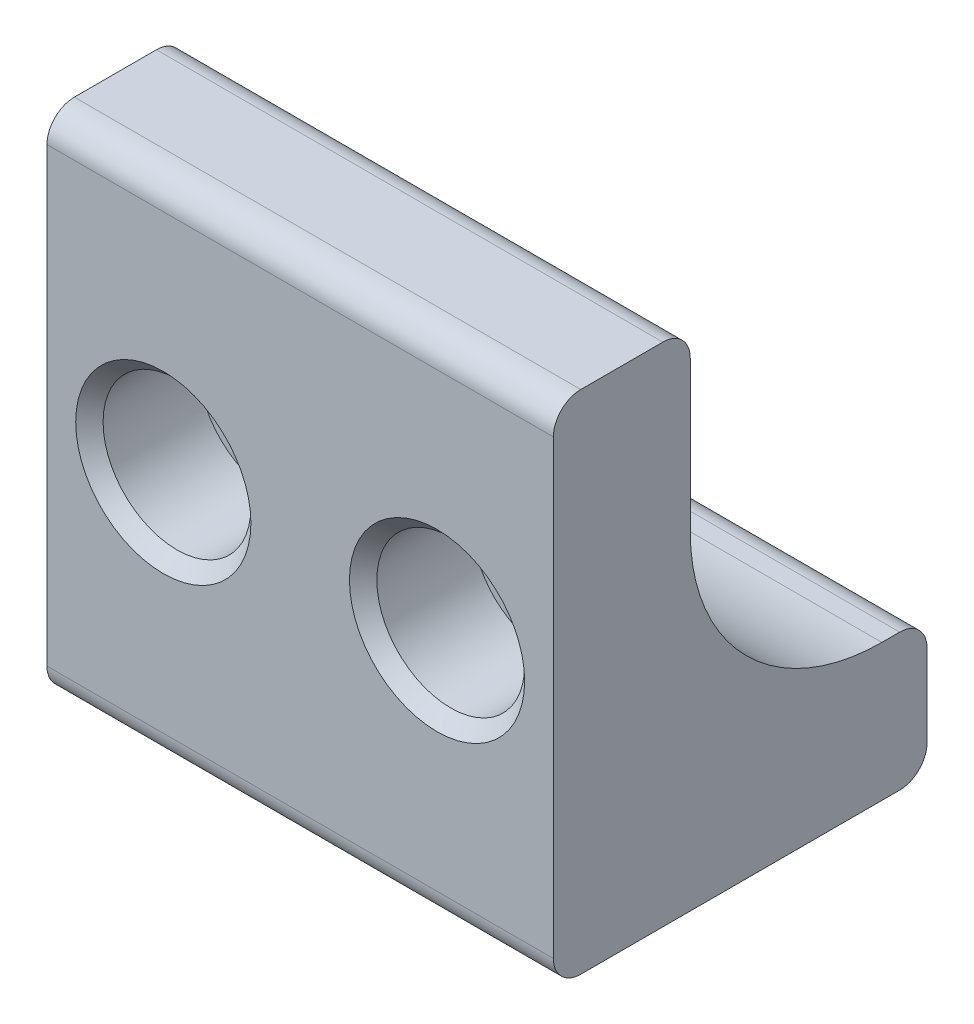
ISO-10303-21;
HEADER;
FILE_DESCRIPTION(('STEP AP214'),'2;1');
FILE_NAME('part.step','',(''),(''),'','','');
FILE_SCHEMA(('AUTOMOTIVE_DESIGN { 1 0 10303 214 1 1 1 1 }'));
ENDSEC;
DATA;
#1=APPLICATION_CONTEXT('core data for automotive mechanical design processes');
#2=APPLICATION_PROTOCOL_DEFINITION('international standard','automotive_design',2000,#1);
#3=PRODUCT_CONTEXT('',#1,'mechanical');
#4=PRODUCT('Part','Part','',(#3));
#5=PRODUCT_RELATED_PRODUCT_CATEGORY('part','',(#4));
#6=PRODUCT_DEFINITION_FORMATION('','',#4);
#7=PRODUCT_DEFINITION_CONTEXT('part definition',#1,'design');
#8=PRODUCT_DEFINITION('design','',#6,#7);
#9=PRODUCT_DEFINITION_SHAPE('','',#8);
#10=(LENGTH_UNIT() NAMED_UNIT(*) SI_UNIT(.MILLI.,.METRE.));
#11=(NAMED_UNIT(*) PLANE_ANGLE_UNIT() SI_UNIT($,.RADIAN.));
#12=(NAMED_UNIT(*) SI_UNIT($,.STERADIAN.) SOLID_ANGLE_UNIT());
#13=UNCERTAINTY_MEASURE_WITH_UNIT(LENGTH_MEASURE(1.E-05),#10,'distance_accuracy_value','');
#14=(GEOMETRIC_REPRESENTATION_CONTEXT(3) GLOBAL_UNCERTAINTY_ASSIGNED_CONTEXT((#13)) GLOBAL_UNIT_ASSIGNED_CONTEXT((#10,
#11,#12)) REPRESENTATION_CONTEXT('',''));
#15=CARTESIAN_POINT('',(0.,0.,0.));
#16=DIRECTION('',(0.,0.,1.));
#17=DIRECTION('',(1.,0.,0.));
#18=AXIS2_PLACEMENT_3D('',#15,#16,#17);
#19=CARTESIAN_POINT('',(41.,-25.49,129.225));
#20=DIRECTION('',(-1.,0.,0.));
#21=DIRECTION('',(0.,0.,1.));
#22=AXIS2_PLACEMENT_3D('',#19,#20,#21);
#23=PLANE('',#22);
#24=DIRECTION('',(0.,-1.,0.));
#25=VECTOR('',#24,1.);
#26=CARTESIAN_POINT('',(41.,-25.49,129.225));
#27=LINE('',#26,#25);
#28=CARTESIAN_POINT('',(41.,-39.99,129.225));
#29=VERTEX_POINT('',#28);
#30=CARTESIAN_POINT('',(41.,-42.99,129.225));
#31=VERTEX_POINT('',#30);
#32=EDGE_CURVE('E142',#29,#31,#27,.T.);
#33=ORIENTED_EDGE('',*,*,#32,.F.);
#34=CARTESIAN_POINT('',(41.,-39.99,130.225));
#35=DIRECTION('',(-1.,0.,0.));
#36=DIRECTION('',(0.,0.,1.));
#37=AXIS2_PLACEMENT_3D('',#34,#35,#36);
#38=CIRCLE('',#37,1.);
#39=CARTESIAN_POINT('',(41.,-38.99,130.225));
#40=VERTEX_POINT('',#39);
#41=EDGE_CURVE('E146',#29,#40,#38,.F.);
#42=ORIENTED_EDGE('',*,*,#41,.T.);
#43=DIRECTION('',(0.,0.,-1.));
#44=VECTOR('',#43,1.);
#45=CARTESIAN_POINT('',(41.,-38.99,129.225));
#46=LINE('',#45,#44);
#47=CARTESIAN_POINT('',(41.,-38.99,130.875));
#48=VERTEX_POINT('',#47);
#49=EDGE_CURVE('E137',#48,#40,#46,.T.);
#50=ORIENTED_EDGE('',*,*,#49,.F.);
#51=CARTESIAN_POINT('',(41.,-31.99,130.875));
#52=DIRECTION('',(-1.,0.,0.));
#53=DIRECTION('',(0.,0.,1.));
#54=AXIS2_PLACEMENT_3D('',#51,#52,#53);
#55=CIRCLE('',#54,7.);
#56=CARTESIAN_POINT('',(41.,-31.99,137.875));
#57=VERTEX_POINT('',#56);
#58=EDGE_CURVE('E122',#48,#57,#55,.T.);
#59=ORIENTED_EDGE('',*,*,#58,.T.);
#60=DIRECTION('',(0.,1.,0.));
#61=VECTOR('',#60,1.);
#62=CARTESIAN_POINT('',(41.,-64.4123529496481,137.875));
#63=LINE('',#62,#61);
#64=CARTESIAN_POINT('',(41.,-26.49,137.875));
#65=VERTEX_POINT('',#64);
#66=EDGE_CURVE('E148',#57,#65,#63,.T.);
#67=ORIENTED_EDGE('',*,*,#66,.T.);
#68=CARTESIAN_POINT('',(41.,-26.49,138.875));
#69=DIRECTION('',(-1.,0.,0.));
#70=DIRECTION('',(0.,0.,1.));
#71=AXIS2_PLACEMENT_3D('',#68,#69,#70);
#72=CIRCLE('',#71,1.);
#73=CARTESIAN_POINT('',(41.,-25.49,138.875));
#74=VERTEX_POINT('',#73);
#75=EDGE_CURVE('E199',#65,#74,#72,.F.);
#76=ORIENTED_EDGE('',*,*,#75,.T.);
#77=DIRECTION('',(0.,0.,-1.));
#78=VECTOR('',#77,1.);
#79=CARTESIAN_POINT('',(41.,-25.49,129.225));
#80=LINE('',#79,#78);
#81=CARTESIAN_POINT('',(41.,-25.49,141.875));
#82=VERTEX_POINT('',#81);
#83=EDGE_CURVE('E162',#82,#74,#80,.T.);
#84=ORIENTED_EDGE('',*,*,#83,.F.);
#85=CARTESIAN_POINT('',(41.,-26.49,141.875));
#86=DIRECTION('',(-1.,0.,0.));
#87=DIRECTION('',(0.,0.,1.));
#88=AXIS2_PLACEMENT_3D('',#85,#86,#87);
#89=CIRCLE('',#88,1.);
#90=CARTESIAN_POINT('',(41.,-26.49,142.875));
#91=VERTEX_POINT('',#90);
#92=EDGE_CURVE('E201',#82,#91,#89,.F.);
#93=ORIENTED_EDGE('',*,*,#92,.T.);
#94=DIRECTION('',(0.,-1.,0.));
#95=VECTOR('',#94,1.);
#96=CARTESIAN_POINT('',(41.,-25.49,142.875));
#97=LINE('',#96,#95);
#98=CARTESIAN_POINT('',(41.,-42.99,142.875));
#99=VERTEX_POINT('',#98);
#100=EDGE_CURVE('E167',#91,#99,#97,.T.);
#101=ORIENTED_EDGE('',*,*,#100,.T.);
#102=CARTESIAN_POINT('',(41.,-42.99,141.875));
#103=DIRECTION('',(-1.,0.,0.));
#104=DIRECTION('',(0.,0.,1.));
#105=AXIS2_PLACEMENT_3D('',#102,#103,#104);
#106=CIRCLE('',#105,1.);
#107=CARTESIAN_POINT('',(41.,-43.99,141.875));
#108=VERTEX_POINT('',#107);
#109=EDGE_CURVE('E54',#99,#108,#106,.F.);
#110=ORIENTED_EDGE('',*,*,#109,.T.);
#111=DIRECTION('',(0.,0.,-1.));
#112=VECTOR('',#111,1.);
#113=CARTESIAN_POINT('',(41.,-43.99,129.225));
#114=LINE('',#113,#112);
#115=CARTESIAN_POINT('',(41.,-43.99,130.225));
#116=VERTEX_POINT('',#115);
#117=EDGE_CURVE('E147',#108,#116,#114,.T.);
#118=ORIENTED_EDGE('',*,*,#117,.T.);
#119=CARTESIAN_POINT('',(41.,-42.99,130.225));
#120=DIRECTION('',(-1.,0.,0.));
#121=DIRECTION('',(0.,0.,1.));
#122=AXIS2_PLACEMENT_3D('',#119,#120,#121);
#123=CIRCLE('',#122,1.);
#124=EDGE_CURVE('E204',#116,#31,#123,.F.);
#125=ORIENTED_EDGE('',*,*,#124,.T.);
#126=EDGE_LOOP('',(#33,#42,#50,#59,#67,#76,#84,#93,#101,#110,#118,#125));
#127=FACE_BOUND('',#126,.T.);
#128=ADVANCED_FACE('F32',(#127),#23,.F.);
#129=CARTESIAN_POINT('',(22.5,-25.49,129.225));
#130=DIRECTION('',(0.,0.,1.));
#131=DIRECTION('',(1.,0.,0.));
#132=AXIS2_PLACEMENT_3D('',#129,#130,#131);
#133=PLANE('',#132);
#134=DIRECTION('',(0.,-1.,0.));
#135=VECTOR('',#134,1.);
#136=CARTESIAN_POINT('',(22.5,-25.49,129.225));
#137=LINE('',#136,#135);
#138=CARTESIAN_POINT('',(22.5,-39.99,129.225));
#139=VERTEX_POINT('',#138);
#140=CARTESIAN_POINT('',(22.5,-42.99,129.225));
#141=VERTEX_POINT('',#140);
#142=EDGE_CURVE('E175',#139,#141,#137,.T.);
#143=ORIENTED_EDGE('',*,*,#142,.F.);
#144=DIRECTION('',(-1.,0.,0.));
#145=VECTOR('',#144,1.);
#146=CARTESIAN_POINT('',(22.5,-39.99,129.225));
#147=LINE('',#146,#145);
#148=EDGE_CURVE('E197',#139,#29,#147,.F.);
#149=ORIENTED_EDGE('',*,*,#148,.T.);
#150=ORIENTED_EDGE('',*,*,#32,.T.);
#151=DIRECTION('',(-1.,0.,0.));
#152=VECTOR('',#151,1.);
#153=CARTESIAN_POINT('',(22.5,-42.99,129.225));
#154=LINE('',#153,#152);
#155=EDGE_CURVE('E194',#31,#141,#154,.T.);
#156=ORIENTED_EDGE('',*,*,#155,.T.);
#157=EDGE_LOOP('',(#143,#149,#150,#156));
#158=FACE_BOUND('',#157,.T.);
#159=ADVANCED_FACE('F260',(#158),#133,.F.);
#160=CARTESIAN_POINT('',(22.5,-25.49,129.225));
#161=DIRECTION('',(1.,0.,0.));
#162=DIRECTION('',(0.,0.,-1.));
#163=AXIS2_PLACEMENT_3D('',#160,#161,#162);
#164=PLANE('',#163);
#165=DIRECTION('',(0.,0.,1.));
#166=VECTOR('',#165,1.);
#167=CARTESIAN_POINT('',(22.5,-38.99,129.225));
#168=LINE('',#167,#166);
#169=CARTESIAN_POINT('',(22.5,-38.99,130.225));
#170=VERTEX_POINT('',#169);
#171=CARTESIAN_POINT('',(22.5,-38.99,130.875));
#172=VERTEX_POINT('',#171);
#173=EDGE_CURVE('E140',#170,#172,#168,.T.);
#174=ORIENTED_EDGE('',*,*,#173,.F.);
#175=CARTESIAN_POINT('',(22.5,-39.99,130.225));
#176=DIRECTION('',(1.,0.,0.));
#177=DIRECTION('',(0.,0.,-1.));
#178=AXIS2_PLACEMENT_3D('',#175,#176,#177);
#179=CIRCLE('',#178,1.);
#180=EDGE_CURVE('E192',#170,#139,#179,.F.);
#181=ORIENTED_EDGE('',*,*,#180,.T.);
#182=ORIENTED_EDGE('',*,*,#142,.T.);
#183=CARTESIAN_POINT('',(22.5,-42.99,130.225));
#184=DIRECTION('',(1.,0.,0.));
#185=DIRECTION('',(0.,0.,-1.));
#186=AXIS2_PLACEMENT_3D('',#183,#184,#185);
#187=CIRCLE('',#186,1.);
#188=CARTESIAN_POINT('',(22.5,-43.99,130.225));
#189=VERTEX_POINT('',#188);
#190=EDGE_CURVE('E190',#141,#189,#187,.F.);
#191=ORIENTED_EDGE('',*,*,#190,.T.);
#192=DIRECTION('',(0.,0.,1.));
#193=VECTOR('',#192,1.);
#194=CARTESIAN_POINT('',(22.5,-43.99,129.225));
#195=LINE('',#194,#193);
#196=CARTESIAN_POINT('',(22.5,-43.99,141.875));
#197=VERTEX_POINT('',#196);
#198=EDGE_CURVE('E150',#189,#197,#195,.T.);
#199=ORIENTED_EDGE('',*,*,#198,.T.);
#200=CARTESIAN_POINT('',(22.5,-42.99,141.875));
#201=DIRECTION('',(1.,0.,0.));
#202=DIRECTION('',(0.,0.,-1.));
#203=AXIS2_PLACEMENT_3D('',#200,#201,#202);
#204=CIRCLE('',#203,1.);
#205=CARTESIAN_POINT('',(22.5,-42.99,142.875));
#206=VERTEX_POINT('',#205);
#207=EDGE_CURVE('E188',#197,#206,#204,.F.);
#208=ORIENTED_EDGE('',*,*,#207,.T.);
#209=DIRECTION('',(0.,-1.,0.));
#210=VECTOR('',#209,1.);
#211=CARTESIAN_POINT('',(22.5,-25.49,142.875));
#212=LINE('',#211,#210);
#213=CARTESIAN_POINT('',(22.5,-26.49,142.875));
#214=VERTEX_POINT('',#213);
#215=EDGE_CURVE('E172',#214,#206,#212,.T.);
#216=ORIENTED_EDGE('',*,*,#215,.F.);
#217=CARTESIAN_POINT('',(22.5,-26.49,141.875));
#218=DIRECTION('',(1.,0.,0.));
#219=DIRECTION('',(0.,0.,-1.));
#220=AXIS2_PLACEMENT_3D('',#217,#218,#219);
#221=CIRCLE('',#220,1.);
#222=CARTESIAN_POINT('',(22.5,-25.49,141.875));
#223=VERTEX_POINT('',#222);
#224=EDGE_CURVE('E186',#214,#223,#221,.F.);
#225=ORIENTED_EDGE('',*,*,#224,.T.);
#226=DIRECTION('',(0.,0.,1.));
#227=VECTOR('',#226,1.);
#228=CARTESIAN_POINT('',(22.5,-25.49,129.225));
#229=LINE('',#228,#227);
#230=CARTESIAN_POINT('',(22.5,-25.49,138.875));
#231=VERTEX_POINT('',#230);
#232=EDGE_CURVE('E165',#231,#223,#229,.T.);
#233=ORIENTED_EDGE('',*,*,#232,.F.);
#234=CARTESIAN_POINT('',(22.5,-26.49,138.875));
#235=DIRECTION('',(1.,0.,0.));
#236=DIRECTION('',(0.,0.,-1.));
#237=AXIS2_PLACEMENT_3D('',#234,#235,#236);
#238=CIRCLE('',#237,1.);
#239=CARTESIAN_POINT('',(22.5,-26.49,137.875));
#240=VERTEX_POINT('',#239);
#241=EDGE_CURVE('E184',#231,#240,#238,.F.);
#242=ORIENTED_EDGE('',*,*,#241,.T.);
#243=DIRECTION('',(0.,1.,0.));
#244=VECTOR('',#243,1.);
#245=CARTESIAN_POINT('',(22.5,-64.4123529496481,137.875));
#246=LINE('',#245,#244);
#247=CARTESIAN_POINT('',(22.5,-31.99,137.875));
#248=VERTEX_POINT('',#247);
#249=EDGE_CURVE('E152',#248,#240,#246,.T.);
#250=ORIENTED_EDGE('',*,*,#249,.F.);
#251=CARTESIAN_POINT('',(22.5,-31.99,130.875));
#252=DIRECTION('',(1.,0.,0.));
#253=DIRECTION('',(0.,0.,-1.));
#254=AXIS2_PLACEMENT_3D('',#251,#252,#253);
#255=CIRCLE('',#254,7.);
#256=EDGE_CURVE('E131',#248,#172,#255,.T.);
#257=ORIENTED_EDGE('',*,*,#256,.T.);
#258=EDGE_LOOP('',(#174,#181,#182,#191,#199,#208,#216,#225,#233,#242,#250,#257));
#259=FACE_BOUND('',#258,.T.);
#260=ADVANCED_FACE('F265',(#259),#164,.F.);
#261=CARTESIAN_POINT('',(22.5,-25.49,142.875));
#262=DIRECTION('',(0.,0.,-1.));
#263=DIRECTION('',(-1.,0.,0.));
#264=AXIS2_PLACEMENT_3D('',#261,#262,#263);
#265=PLANE('',#264);
#266=CARTESIAN_POINT('',(26.75,-34.74,142.875));
#267=DIRECTION('',(0.,0.,-1.));
#268=DIRECTION('',(-1.,0.,0.));
#269=AXIS2_PLACEMENT_3D('',#266,#267,#268);
#270=CIRCLE('',#269,3.20000000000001);
#271=CARTESIAN_POINT('',(23.55,-34.74,142.875));
#272=VERTEX_POINT('',#271);
#273=EDGE_CURVE('E229',#272,#272,#270,.T.);
#274=ORIENTED_EDGE('',*,*,#273,.T.);
#275=EDGE_LOOP('',(#274));
#276=FACE_BOUND('',#275,.T.);
#277=CARTESIAN_POINT('',(36.75,-34.74,142.875));
#278=DIRECTION('',(0.,0.,-1.));
#279=DIRECTION('',(-1.,0.,0.));
#280=AXIS2_PLACEMENT_3D('',#277,#278,#279);
#281=CIRCLE('',#280,3.20000000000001);
#282=CARTESIAN_POINT('',(33.55,-34.74,142.875));
#283=VERTEX_POINT('',#282);
#284=EDGE_CURVE('E226',#283,#283,#281,.T.);
#285=ORIENTED_EDGE('',*,*,#284,.T.);
#286=EDGE_LOOP('',(#285));
#287=FACE_BOUND('',#286,.T.);
#288=ORIENTED_EDGE('',*,*,#215,.T.);
#289=DIRECTION('',(1.,0.,0.));
#290=VECTOR('',#289,1.);
#291=CARTESIAN_POINT('',(22.5,-42.99,142.875));
#292=LINE('',#291,#290);
#293=EDGE_CURVE('E212',#206,#99,#292,.T.);
#294=ORIENTED_EDGE('',*,*,#293,.T.);
#295=ORIENTED_EDGE('',*,*,#100,.F.);
#296=DIRECTION('',(1.,0.,0.));
#297=VECTOR('',#296,1.);
#298=CARTESIAN_POINT('',(22.5,-26.49,142.875));
#299=LINE('',#298,#297);
#300=EDGE_CURVE('E210',#91,#214,#299,.F.);
#301=ORIENTED_EDGE('',*,*,#300,.T.);
#302=EDGE_LOOP('',(#288,#294,#295,#301));
#303=FACE_BOUND('',#302,.T.);
#304=ADVANCED_FACE('F354',(#276,#287,#303),#265,.F.);
#305=CARTESIAN_POINT('',(0.,-25.49,0.));
#306=DIRECTION('',(0.,1.,0.));
#307=DIRECTION('',(0.,0.,1.));
#308=AXIS2_PLACEMENT_3D('',#305,#306,#307);
#309=PLANE('',#308);
#310=ORIENTED_EDGE('',*,*,#232,.T.);
#311=DIRECTION('',(1.,0.,0.));
#312=VECTOR('',#311,1.);
#313=CARTESIAN_POINT('',(41.,-25.49,141.875));
#314=LINE('',#313,#312);
#315=EDGE_CURVE('E217',#223,#82,#314,.T.);
#316=ORIENTED_EDGE('',*,*,#315,.T.);
#317=ORIENTED_EDGE('',*,*,#83,.T.);
#318=DIRECTION('',(1.,0.,0.));
#319=VECTOR('',#318,1.);
#320=CARTESIAN_POINT('',(22.5,-25.49,138.875));
#321=LINE('',#320,#319);
#322=EDGE_CURVE('E215',#74,#231,#321,.F.);
#323=ORIENTED_EDGE('',*,*,#322,.T.);
#324=EDGE_LOOP('',(#310,#316,#317,#323));
#325=FACE_BOUND('',#324,.T.);
#326=ADVANCED_FACE('F351',(#325),#309,.T.);
#327=CARTESIAN_POINT('',(0.,-43.99,0.));
#328=DIRECTION('',(0.,1.,0.));
#329=DIRECTION('',(0.,0.,1.));
#330=AXIS2_PLACEMENT_3D('',#327,#328,#329);
#331=PLANE('',#330);
#332=CARTESIAN_POINT('',(26.75,-43.99,136.05));
#333=DIRECTION('',(0.,1.,0.));
#334=DIRECTION('',(0.,0.,1.));
#335=AXIS2_PLACEMENT_3D('',#332,#333,#334);
#336=CIRCLE('',#335,3.20000000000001);
#337=CARTESIAN_POINT('',(26.75,-43.99,139.25));
#338=VERTEX_POINT('',#337);
#339=EDGE_CURVE('E238',#338,#338,#336,.T.);
#340=ORIENTED_EDGE('',*,*,#339,.T.);
#341=EDGE_LOOP('',(#340));
#342=FACE_BOUND('',#341,.T.);
#343=CARTESIAN_POINT('',(36.75,-43.99,136.05));
#344=DIRECTION('',(0.,1.,0.));
#345=DIRECTION('',(0.,0.,1.));
#346=AXIS2_PLACEMENT_3D('',#343,#344,#345);
#347=CIRCLE('',#346,3.20000000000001);
#348=CARTESIAN_POINT('',(36.75,-43.99,139.25));
#349=VERTEX_POINT('',#348);
#350=EDGE_CURVE('E235',#349,#349,#347,.T.);
#351=ORIENTED_EDGE('',*,*,#350,.T.);
#352=EDGE_LOOP('',(#351));
#353=FACE_BOUND('',#352,.T.);
#354=ORIENTED_EDGE('',*,*,#198,.F.);
#355=DIRECTION('',(-1.,0.,0.));
#356=VECTOR('',#355,1.);
#357=CARTESIAN_POINT('',(0.,-43.99,130.225));
#358=LINE('',#357,#356);
#359=EDGE_CURVE('E47',#189,#116,#358,.F.);
#360=ORIENTED_EDGE('',*,*,#359,.T.);
#361=ORIENTED_EDGE('',*,*,#117,.F.);
#362=DIRECTION('',(1.,0.,0.));
#363=VECTOR('',#362,1.);
#364=CARTESIAN_POINT('',(0.,-43.99,141.875));
#365=LINE('',#364,#363);
#366=EDGE_CURVE('E207',#108,#197,#365,.F.);
#367=ORIENTED_EDGE('',*,*,#366,.T.);
#368=EDGE_LOOP('',(#354,#360,#361,#367));
#369=FACE_BOUND('',#368,.T.);
#370=ADVANCED_FACE('F350',(#342,#353,#369),#331,.F.);
#371=CARTESIAN_POINT('',(0.,-38.99,-240.705250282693));
#372=DIRECTION('',(0.,-1.,0.));
#373=DIRECTION('',(0.,0.,1.));
#374=AXIS2_PLACEMENT_3D('',#371,#372,#373);
#375=PLANE('',#374);
#376=ORIENTED_EDGE('',*,*,#49,.T.);
#377=DIRECTION('',(-1.,0.,0.));
#378=VECTOR('',#377,1.);
#379=CARTESIAN_POINT('',(0.,-38.99,130.225));
#380=LINE('',#379,#378);
#381=EDGE_CURVE('E182',#40,#170,#380,.T.);
#382=ORIENTED_EDGE('',*,*,#381,.T.);
#383=ORIENTED_EDGE('',*,*,#173,.T.);
#384=DIRECTION('',(1.,0.,0.));
#385=VECTOR('',#384,1.);
#386=CARTESIAN_POINT('',(41.,-38.99,130.875));
#387=LINE('',#386,#385);
#388=EDGE_CURVE('E126',#172,#48,#387,.T.);
#389=ORIENTED_EDGE('',*,*,#388,.T.);
#390=EDGE_LOOP('',(#376,#382,#383,#389));
#391=FACE_BOUND('',#390,.T.);
#392=ADVANCED_FACE('F135',(#391),#375,.F.);
#393=CARTESIAN_POINT('',(41.,-64.4123529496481,137.875));
#394=DIRECTION('',(0.,0.,1.));
#395=DIRECTION('',(1.,0.,0.));
#396=AXIS2_PLACEMENT_3D('',#393,#394,#395);
#397=PLANE('',#396);
#398=ORIENTED_EDGE('',*,*,#249,.T.);
#399=DIRECTION('',(1.,0.,0.));
#400=VECTOR('',#399,1.);
#401=CARTESIAN_POINT('',(41.,-26.49,137.875));
#402=LINE('',#401,#400);
#403=EDGE_CURVE('E220',#240,#65,#402,.T.);
#404=ORIENTED_EDGE('',*,*,#403,.T.);
#405=ORIENTED_EDGE('',*,*,#66,.F.);
#406=DIRECTION('',(1.,0.,0.));
#407=VECTOR('',#406,1.);
#408=CARTESIAN_POINT('',(22.5,-31.99,137.875));
#409=LINE('',#408,#407);
#410=EDGE_CURVE('E127',#57,#248,#409,.F.);
#411=ORIENTED_EDGE('',*,*,#410,.T.);
#412=EDGE_LOOP('',(#398,#404,#405,#411));
#413=FACE_BOUND('',#412,.T.);
#414=ADVANCED_FACE('F273',(#413),#397,.F.);
#415=CARTESIAN_POINT('',(0.,-31.99,130.875));
#416=DIRECTION('',(-1.,0.,0.));
#417=DIRECTION('',(0.,0.,1.));
#418=AXIS2_PLACEMENT_3D('',#415,#416,#417);
#419=CYLINDRICAL_SURFACE('',#418,7.);
#420=ORIENTED_EDGE('',*,*,#256,.F.);
#421=ORIENTED_EDGE('',*,*,#410,.F.);
#422=ORIENTED_EDGE('',*,*,#58,.F.);
#423=ORIENTED_EDGE('',*,*,#388,.F.);
#424=EDGE_LOOP('',(#420,#421,#422,#423));
#425=FACE_BOUND('',#424,.T.);
#426=ADVANCED_FACE('F125',(#425),#419,.F.);
#427=CARTESIAN_POINT('',(0.,-39.99,130.225));
#428=DIRECTION('',(-1.,0.,0.));
#429=DIRECTION('',(0.,0.,1.));
#430=AXIS2_PLACEMENT_3D('',#427,#428,#429);
#431=CYLINDRICAL_SURFACE('',#430,1.);
#432=ORIENTED_EDGE('',*,*,#41,.F.);
#433=ORIENTED_EDGE('',*,*,#148,.F.);
#434=ORIENTED_EDGE('',*,*,#180,.F.);
#435=ORIENTED_EDGE('',*,*,#381,.F.);
#436=EDGE_LOOP('',(#432,#433,#434,#435));
#437=FACE_BOUND('',#436,.T.);
#438=ADVANCED_FACE('F272',(#437),#431,.T.);
#439=CARTESIAN_POINT('',(22.5,-42.99,130.225));
#440=DIRECTION('',(-1.,0.,0.));
#441=DIRECTION('',(0.,0.,1.));
#442=AXIS2_PLACEMENT_3D('',#439,#440,#441);
#443=CYLINDRICAL_SURFACE('',#442,1.);
#444=ORIENTED_EDGE('',*,*,#124,.F.);
#445=ORIENTED_EDGE('',*,*,#359,.F.);
#446=ORIENTED_EDGE('',*,*,#190,.F.);
#447=ORIENTED_EDGE('',*,*,#155,.F.);
#448=EDGE_LOOP('',(#444,#445,#446,#447));
#449=FACE_BOUND('',#448,.T.);
#450=ADVANCED_FACE('F276',(#449),#443,.T.);
#451=CARTESIAN_POINT('',(22.5,-42.99,141.875));
#452=DIRECTION('',(1.,0.,0.));
#453=DIRECTION('',(0.,0.,-1.));
#454=AXIS2_PLACEMENT_3D('',#451,#452,#453);
#455=CYLINDRICAL_SURFACE('',#454,1.);
#456=ORIENTED_EDGE('',*,*,#207,.F.);
#457=ORIENTED_EDGE('',*,*,#366,.F.);
#458=ORIENTED_EDGE('',*,*,#109,.F.);
#459=ORIENTED_EDGE('',*,*,#293,.F.);
#460=EDGE_LOOP('',(#456,#457,#458,#459));
#461=FACE_BOUND('',#460,.T.);
#462=ADVANCED_FACE('F280',(#461),#455,.T.);
#463=CARTESIAN_POINT('',(0.,-26.49,141.875));
#464=DIRECTION('',(-1.,0.,0.));
#465=DIRECTION('',(0.,0.,1.));
#466=AXIS2_PLACEMENT_3D('',#463,#464,#465);
#467=CYLINDRICAL_SURFACE('',#466,1.);
#468=ORIENTED_EDGE('',*,*,#224,.F.);
#469=ORIENTED_EDGE('',*,*,#300,.F.);
#470=ORIENTED_EDGE('',*,*,#92,.F.);
#471=ORIENTED_EDGE('',*,*,#315,.F.);
#472=EDGE_LOOP('',(#468,#469,#470,#471));
#473=FACE_BOUND('',#472,.T.);
#474=ADVANCED_FACE('F284',(#473),#467,.T.);
#475=CARTESIAN_POINT('',(41.,-26.49,138.875));
#476=DIRECTION('',(-1.,0.,0.));
#477=DIRECTION('',(0.,0.,1.));
#478=AXIS2_PLACEMENT_3D('',#475,#476,#477);
#479=CYLINDRICAL_SURFACE('',#478,1.);
#480=ORIENTED_EDGE('',*,*,#241,.F.);
#481=ORIENTED_EDGE('',*,*,#322,.F.);
#482=ORIENTED_EDGE('',*,*,#75,.F.);
#483=ORIENTED_EDGE('',*,*,#403,.F.);
#484=EDGE_LOOP('',(#480,#481,#482,#483));
#485=FACE_BOUND('',#484,.T.);
#486=ADVANCED_FACE('F288',(#485),#479,.T.);
#487=CARTESIAN_POINT('',(36.75,-34.74,138.875));
#488=DIRECTION('',(0.,0.,1.));
#489=DIRECTION('',(1.,0.,0.));
#490=AXIS2_PLACEMENT_3D('',#487,#488,#489);
#491=CYLINDRICAL_SURFACE('',#490,2.7);
#492=CARTESIAN_POINT('',(36.75,-34.74,142.375));
#493=DIRECTION('',(0.,0.,-1.));
#494=DIRECTION('',(-1.,0.,0.));
#495=AXIS2_PLACEMENT_3D('',#492,#493,#494);
#496=CIRCLE('',#495,2.7);
#497=CARTESIAN_POINT('',(34.05,-34.74,142.375));
#498=VERTEX_POINT('',#497);
#499=EDGE_CURVE('E11',#498,#498,#496,.F.);
#500=ORIENTED_EDGE('',*,*,#499,.T.);
#501=EDGE_LOOP('',(#500));
#502=FACE_BOUND('',#501,.T.);
#503=CARTESIAN_POINT('',(36.75,-34.74,138.875));
#504=DIRECTION('',(0.,0.,1.));
#505=DIRECTION('',(1.,0.,0.));
#506=AXIS2_PLACEMENT_3D('',#503,#504,#505);
#507=CIRCLE('',#506,2.7);
#508=CARTESIAN_POINT('',(39.45,-34.74,138.875));
#509=VERTEX_POINT('',#508);
#510=EDGE_CURVE('E156',#509,#509,#507,.T.);
#511=ORIENTED_EDGE('',*,*,#510,.F.);
#512=EDGE_LOOP('',(#511));
#513=FACE_BOUND('',#512,.T.);
#514=ADVANCED_FACE('F292',(#502,#513),#491,.F.);
#515=CARTESIAN_POINT('',(36.75,-34.74,138.875));
#516=DIRECTION('',(0.,0.,1.));
#517=DIRECTION('',(1.,0.,0.));
#518=AXIS2_PLACEMENT_3D('',#515,#516,#517);
#519=PLANE('',#518);
#520=ORIENTED_EDGE('',*,*,#510,.T.);
#521=EDGE_LOOP('',(#520));
#522=FACE_BOUND('',#521,.T.);
#523=ADVANCED_FACE('F311',(#522),#519,.T.);
#524=CARTESIAN_POINT('',(26.75,-34.74,138.875));
#525=DIRECTION('',(0.,0.,1.));
#526=DIRECTION('',(1.,0.,0.));
#527=AXIS2_PLACEMENT_3D('',#524,#525,#526);
#528=CYLINDRICAL_SURFACE('',#527,2.7);
#529=CARTESIAN_POINT('',(26.75,-34.74,142.375));
#530=DIRECTION('',(0.,0.,-1.));
#531=DIRECTION('',(-1.,0.,0.));
#532=AXIS2_PLACEMENT_3D('',#529,#530,#531);
#533=CIRCLE('',#532,2.7);
#534=CARTESIAN_POINT('',(24.05,-34.74,142.375));
#535=VERTEX_POINT('',#534);
#536=EDGE_CURVE('E223',#535,#535,#533,.F.);
#537=ORIENTED_EDGE('',*,*,#536,.T.);
#538=EDGE_LOOP('',(#537));
#539=FACE_BOUND('',#538,.T.);
#540=CARTESIAN_POINT('',(26.75,-34.74,138.875));
#541=DIRECTION('',(0.,0.,1.));
#542=DIRECTION('',(1.,0.,0.));
#543=AXIS2_PLACEMENT_3D('',#540,#541,#542);
#544=CIRCLE('',#543,2.7);
#545=CARTESIAN_POINT('',(29.45,-34.74,138.875));
#546=VERTEX_POINT('',#545);
#547=EDGE_CURVE('E158',#546,#546,#544,.T.);
#548=ORIENTED_EDGE('',*,*,#547,.F.);
#549=EDGE_LOOP('',(#548));
#550=FACE_BOUND('',#549,.T.);
#551=ADVANCED_FACE('F307',(#539,#550),#528,.F.);
#552=CARTESIAN_POINT('',(26.75,-34.74,138.875));
#553=DIRECTION('',(0.,0.,1.));
#554=DIRECTION('',(1.,0.,0.));
#555=AXIS2_PLACEMENT_3D('',#552,#553,#554);
#556=PLANE('',#555);
#557=ORIENTED_EDGE('',*,*,#547,.T.);
#558=EDGE_LOOP('',(#557));
#559=FACE_BOUND('',#558,.T.);
#560=ADVANCED_FACE('F310',(#559),#556,.T.);
#561=CARTESIAN_POINT('',(36.75,-39.99,136.05));
#562=DIRECTION('',(0.,-1.,0.));
#563=DIRECTION('',(0.,0.,-1.));
#564=AXIS2_PLACEMENT_3D('',#561,#562,#563);
#565=CYLINDRICAL_SURFACE('',#564,2.7);
#566=CARTESIAN_POINT('',(36.75,-43.49,136.05));
#567=DIRECTION('',(0.,1.,0.));
#568=DIRECTION('',(0.,0.,1.));
#569=AXIS2_PLACEMENT_3D('',#566,#567,#568);
#570=CIRCLE('',#569,2.7);
#571=CARTESIAN_POINT('',(36.75,-43.49,138.75));
#572=VERTEX_POINT('',#571);
#573=EDGE_CURVE('E40',#572,#572,#570,.F.);
#574=ORIENTED_EDGE('',*,*,#573,.T.);
#575=EDGE_LOOP('',(#574));
#576=FACE_BOUND('',#575,.T.);
#577=CARTESIAN_POINT('',(36.75,-39.99,136.05));
#578=DIRECTION('',(0.,-1.,0.));
#579=DIRECTION('',(0.,0.,-1.));
#580=AXIS2_PLACEMENT_3D('',#577,#578,#579);
#581=CIRCLE('',#580,2.7);
#582=CARTESIAN_POINT('',(36.75,-39.99,133.35));
#583=VERTEX_POINT('',#582);
#584=EDGE_CURVE('E319',#583,#583,#581,.T.);
#585=ORIENTED_EDGE('',*,*,#584,.F.);
#586=EDGE_LOOP('',(#585));
#587=FACE_BOUND('',#586,.T.);
#588=ADVANCED_FACE('F243',(#576,#587),#565,.F.);
#589=CARTESIAN_POINT('',(36.75,-39.99,136.05));
#590=DIRECTION('',(0.,-1.,0.));
#591=DIRECTION('',(0.,0.,-1.));
#592=AXIS2_PLACEMENT_3D('',#589,#590,#591);
#593=PLANE('',#592);
#594=ORIENTED_EDGE('',*,*,#584,.T.);
#595=EDGE_LOOP('',(#594));
#596=FACE_BOUND('',#595,.T.);
#597=ADVANCED_FACE('F326',(#596),#593,.T.);
#598=CARTESIAN_POINT('',(26.75,-39.99,136.05));
#599=DIRECTION('',(0.,-1.,0.));
#600=DIRECTION('',(0.,0.,-1.));
#601=AXIS2_PLACEMENT_3D('',#598,#599,#600);
#602=CYLINDRICAL_SURFACE('',#601,2.7);
#603=CARTESIAN_POINT('',(26.75,-43.49,136.05));
#604=DIRECTION('',(0.,1.,0.));
#605=DIRECTION('',(0.,0.,1.));
#606=AXIS2_PLACEMENT_3D('',#603,#604,#605);
#607=CIRCLE('',#606,2.7);
#608=CARTESIAN_POINT('',(26.75,-43.49,138.75));
#609=VERTEX_POINT('',#608);
#610=EDGE_CURVE('E232',#609,#609,#607,.F.);
#611=ORIENTED_EDGE('',*,*,#610,.T.);
#612=EDGE_LOOP('',(#611));
#613=FACE_BOUND('',#612,.T.);
#614=CARTESIAN_POINT('',(26.75,-39.99,136.05));
#615=DIRECTION('',(0.,-1.,0.));
#616=DIRECTION('',(0.,0.,-1.));
#617=AXIS2_PLACEMENT_3D('',#614,#615,#616);
#618=CIRCLE('',#617,2.7);
#619=CARTESIAN_POINT('',(26.75,-39.99,133.35));
#620=VERTEX_POINT('',#619);
#621=EDGE_CURVE('E317',#620,#620,#618,.T.);
#622=ORIENTED_EDGE('',*,*,#621,.F.);
#623=EDGE_LOOP('',(#622));
#624=FACE_BOUND('',#623,.T.);
#625=ADVANCED_FACE('F300',(#613,#624),#602,.F.);
#626=CARTESIAN_POINT('',(26.75,-39.99,136.05));
#627=DIRECTION('',(0.,-1.,0.));
#628=DIRECTION('',(0.,0.,-1.));
#629=AXIS2_PLACEMENT_3D('',#626,#627,#628);
#630=PLANE('',#629);
#631=ORIENTED_EDGE('',*,*,#621,.T.);
#632=EDGE_LOOP('',(#631));
#633=FACE_BOUND('',#632,.T.);
#634=ADVANCED_FACE('F295',(#633),#630,.T.);
#635=CARTESIAN_POINT('',(26.75,-34.74,142.375));
#636=DIRECTION('',(0.,0.,1.));
#637=DIRECTION('',(1.,0.,0.));
#638=AXIS2_PLACEMENT_3D('',#635,#636,#637);
#639=CONICAL_SURFACE('',#638,2.7,0.785398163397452);
#640=ORIENTED_EDGE('',*,*,#273,.F.);
#641=EDGE_LOOP('',(#640));
#642=FACE_BOUND('',#641,.T.);
#643=ORIENTED_EDGE('',*,*,#536,.F.);
#644=EDGE_LOOP('',(#643));
#645=FACE_BOUND('',#644,.T.);
#646=ADVANCED_FACE('F255',(#642,#645),#639,.F.);
#647=CARTESIAN_POINT('',(26.75,-43.49,136.05));
#648=DIRECTION('',(0.,-1.,0.));
#649=DIRECTION('',(0.,0.,-1.));
#650=AXIS2_PLACEMENT_3D('',#647,#648,#649);
#651=CONICAL_SURFACE('',#650,2.7,0.785398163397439);
#652=ORIENTED_EDGE('',*,*,#339,.F.);
#653=EDGE_LOOP('',(#652));
#654=FACE_BOUND('',#653,.T.);
#655=ORIENTED_EDGE('',*,*,#610,.F.);
#656=EDGE_LOOP('',(#655));
#657=FACE_BOUND('',#656,.T.);
#658=ADVANCED_FACE('F248',(#654,#657),#651,.F.);
#659=CARTESIAN_POINT('',(36.75,-43.49,136.05));
#660=DIRECTION('',(0.,-1.,0.));
#661=DIRECTION('',(0.,0.,-1.));
#662=AXIS2_PLACEMENT_3D('',#659,#660,#661);
#663=CONICAL_SURFACE('',#662,2.7,0.785398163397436);
#664=ORIENTED_EDGE('',*,*,#350,.F.);
#665=EDGE_LOOP('',(#664));
#666=FACE_BOUND('',#665,.T.);
#667=ORIENTED_EDGE('',*,*,#573,.F.);
#668=EDGE_LOOP('',(#667));
#669=FACE_BOUND('',#668,.T.);
#670=ADVANCED_FACE('F246',(#666,#669),#663,.F.);
#671=CARTESIAN_POINT('',(36.75,-34.74,142.375));
#672=DIRECTION('',(0.,0.,1.));
#673=DIRECTION('',(1.,0.,0.));
#674=AXIS2_PLACEMENT_3D('',#671,#672,#673);
#675=CONICAL_SURFACE('',#674,2.7,0.785398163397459);
#676=ORIENTED_EDGE('',*,*,#284,.F.);
#677=EDGE_LOOP('',(#676));
#678=FACE_BOUND('',#677,.T.);
#679=ORIENTED_EDGE('',*,*,#499,.F.);
#680=EDGE_LOOP('',(#679));
#681=FACE_BOUND('',#680,.T.);
#682=ADVANCED_FACE('F34',(#678,#681),#675,.F.);
#683=CLOSED_SHELL('',(#128,#159,#260,#304,#326,#370,#392,#414,#426,#438,#450,#462,#474,#486,
#514,#523,#551,#560,#588,#597,#625,#634,#646,#658,#670,#682));
#684=MANIFOLD_SOLID_BREP('B2',#683);
#685=ADVANCED_BREP_SHAPE_REPRESENTATION('',(#18,#684),#14);
#686=SHAPE_DEFINITION_REPRESENTATION(#9,#685);
ENDSEC;
END-ISO-10303-21;
